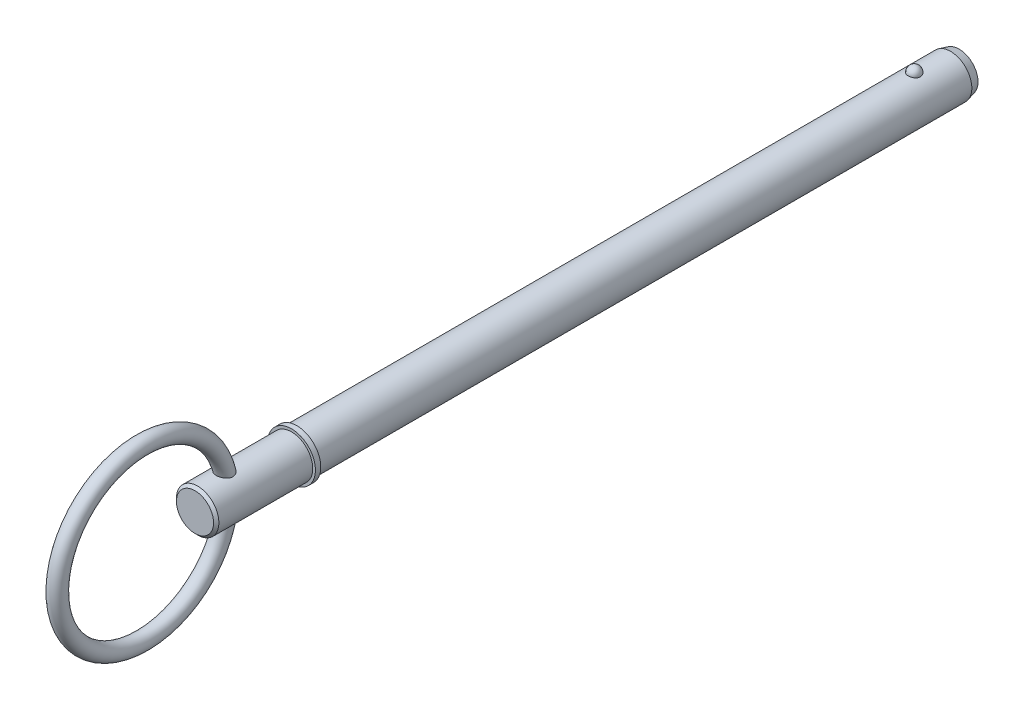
ISO-10303-21;
HEADER;
FILE_DESCRIPTION(('STEP AP214'),'2;1');
FILE_NAME('part.step','',(''),(''),'','','');
FILE_SCHEMA(('AUTOMOTIVE_DESIGN { 1 0 10303 214 1 1 1 1 }'));
ENDSEC;
DATA;
#1=APPLICATION_CONTEXT('core data for automotive mechanical design processes');
#2=APPLICATION_PROTOCOL_DEFINITION('international standard','automotive_design',2000,#1);
#3=PRODUCT_CONTEXT('',#1,'mechanical');
#4=PRODUCT('Part','Part','',(#3));
#5=PRODUCT_RELATED_PRODUCT_CATEGORY('part','',(#4));
#6=PRODUCT_DEFINITION_FORMATION('','',#4);
#7=PRODUCT_DEFINITION_CONTEXT('part definition',#1,'design');
#8=PRODUCT_DEFINITION('design','',#6,#7);
#9=PRODUCT_DEFINITION_SHAPE('','',#8);
#10=(LENGTH_UNIT() NAMED_UNIT(*) SI_UNIT(.MILLI.,.METRE.));
#11=(NAMED_UNIT(*) PLANE_ANGLE_UNIT() SI_UNIT($,.RADIAN.));
#12=(NAMED_UNIT(*) SI_UNIT($,.STERADIAN.) SOLID_ANGLE_UNIT());
#13=UNCERTAINTY_MEASURE_WITH_UNIT(LENGTH_MEASURE(1.E-05),#10,'distance_accuracy_value','');
#14=(GEOMETRIC_REPRESENTATION_CONTEXT(3) GLOBAL_UNCERTAINTY_ASSIGNED_CONTEXT((#13)) GLOBAL_UNIT_ASSIGNED_CONTEXT((#10,
#11,#12)) REPRESENTATION_CONTEXT('',''));
#15=CARTESIAN_POINT('',(0.,0.,0.));
#16=DIRECTION('',(0.,0.,1.));
#17=DIRECTION('',(1.,0.,0.));
#18=AXIS2_PLACEMENT_3D('',#15,#16,#17);
#19=CARTESIAN_POINT('',(0.,0.,114.3));
#20=DIRECTION('',(0.,0.,-1.));
#21=DIRECTION('',(-1.,0.,0.));
#22=AXIS2_PLACEMENT_3D('',#19,#20,#21);
#23=CYLINDRICAL_SURFACE('',#22,3.97);
#24=CARTESIAN_POINT('',(1.13787398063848,3.80343828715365,-1.14999999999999));
#25=CARTESIAN_POINT('',(1.13787307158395,3.80343910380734,-1.08573978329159));
#26=CARTESIAN_POINT('',(1.13264657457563,3.80501406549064,-1.02146820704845));
#27=CARTESIAN_POINT('',(1.11186534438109,3.81113760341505,-0.89474994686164));
#28=CARTESIAN_POINT('',(1.09630734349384,3.81568712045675,-0.832303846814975));
#29=CARTESIAN_POINT('',(1.05525533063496,3.82724281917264,-0.711040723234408));
#30=CARTESIAN_POINT('',(1.02976565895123,3.83424792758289,-0.652222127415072));
#31=CARTESIAN_POINT('',(0.969477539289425,3.84993235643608,-0.539814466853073));
#32=CARTESIAN_POINT('',(0.934679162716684,3.85861166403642,-0.486225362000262));
#33=CARTESIAN_POINT('',(0.856427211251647,3.87673176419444,-0.385470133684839));
#34=CARTESIAN_POINT('',(0.812928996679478,3.88617632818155,-0.338339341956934));
#35=CARTESIAN_POINT('',(0.718506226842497,3.90473543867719,-0.252134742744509));
#36=CARTESIAN_POINT('',(0.667581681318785,3.91384998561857,-0.213060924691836));
#37=CARTESIAN_POINT('',(0.559829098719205,3.93070626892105,-0.144169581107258));
#38=CARTESIAN_POINT('',(0.503019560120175,3.93845211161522,-0.114324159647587));
#39=CARTESIAN_POINT('',(0.384957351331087,3.95173781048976,-0.0645874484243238));
#40=CARTESIAN_POINT('',(0.323705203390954,3.95727792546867,-0.044694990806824));
#41=CARTESIAN_POINT('',(0.1997490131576,3.96544869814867,-0.015729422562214));
#42=CARTESIAN_POINT('',(0.137095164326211,3.96813298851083,-0.00645660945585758));
#43=CARTESIAN_POINT('',(0.0110617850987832,3.97048461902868,0.0016793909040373));
#44=CARTESIAN_POINT('',(-0.0523176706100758,3.97015226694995,0.00054364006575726));
#45=CARTESIAN_POINT('',(-0.176983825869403,3.96653606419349,-0.0120046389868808));
#46=CARTESIAN_POINT('',(-0.238287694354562,3.96329719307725,-0.0232605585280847));
#47=CARTESIAN_POINT('',(-0.358077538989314,3.95427494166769,-0.0555133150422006));
#48=CARTESIAN_POINT('',(-0.41656346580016,3.94849151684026,-0.0765103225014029));
#49=CARTESIAN_POINT('',(-0.529474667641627,3.9349475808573,-0.127824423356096));
#50=CARTESIAN_POINT('',(-0.583873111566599,3.92717527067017,-0.158197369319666));
#51=CARTESIAN_POINT('',(-0.686796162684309,3.9104901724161,-0.227402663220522));
#52=CARTESIAN_POINT('',(-0.735320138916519,3.90157726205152,-0.266235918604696));
#53=CARTESIAN_POINT('',(-0.826197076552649,3.88336108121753,-0.352210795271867));
#54=CARTESIAN_POINT('',(-0.868404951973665,3.87405356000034,-0.399504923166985));
#55=CARTESIAN_POINT('',(-0.944393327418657,3.85623507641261,-0.500572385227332));
#56=CARTESIAN_POINT('',(-0.978173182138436,3.84772417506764,-0.5543462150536));
#57=CARTESIAN_POINT('',(-1.036841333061,3.83233550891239,-0.66762403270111));
#58=CARTESIAN_POINT('',(-1.06161430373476,3.82547928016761,-0.727190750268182));
#59=CARTESIAN_POINT('',(-1.1010562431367,3.81431496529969,-0.849806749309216));
#60=CARTESIAN_POINT('',(-1.11572551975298,3.81000680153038,-0.9128559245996));
#61=CARTESIAN_POINT('',(-1.13455293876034,3.80444307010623,-1.0403529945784));
#62=CARTESIAN_POINT('',(-1.13875701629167,3.80317416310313,-1.10479351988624));
#63=CARTESIAN_POINT('',(-1.13668244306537,3.80379469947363,-1.23348881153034));
#64=CARTESIAN_POINT('',(-1.13040410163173,3.80568404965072,-1.29774358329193));
#65=CARTESIAN_POINT('',(-1.10758455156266,3.81238701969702,-1.42388263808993));
#66=CARTESIAN_POINT('',(-1.09109911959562,3.81718474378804,-1.48577787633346));
#67=CARTESIAN_POINT('',(-1.04831897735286,3.82915360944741,-1.60583632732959));
#68=CARTESIAN_POINT('',(-1.02202385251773,3.83632485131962,-1.66399938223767));
#69=CARTESIAN_POINT('',(-0.960087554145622,3.85229234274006,-1.77531672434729));
#70=CARTESIAN_POINT('',(-0.924393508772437,3.86109769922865,-1.82844028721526));
#71=CARTESIAN_POINT('',(-0.844617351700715,3.87932868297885,-1.9278464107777));
#72=CARTESIAN_POINT('',(-0.800534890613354,3.88875433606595,-1.97412868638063));
#73=CARTESIAN_POINT('',(-0.704909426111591,3.90722138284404,-2.05875748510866));
#74=CARTESIAN_POINT('',(-0.653336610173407,3.91626104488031,-2.09707073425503));
#75=CARTESIAN_POINT('',(-0.544251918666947,3.93290335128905,-2.16444159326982));
#76=CARTESIAN_POINT('',(-0.486740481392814,3.94050610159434,-2.19349988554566));
#77=CARTESIAN_POINT('',(-0.368186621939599,3.95333328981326,-2.2412060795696));
#78=CARTESIAN_POINT('',(-0.307200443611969,3.9585876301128,-2.25998559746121));
#79=CARTESIAN_POINT('',(-0.182787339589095,3.96627905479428,-2.28716436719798));
#80=CARTESIAN_POINT('',(-0.119360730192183,3.96871650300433,-2.29556495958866));
#81=CARTESIAN_POINT('',(0.00676344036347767,3.97048518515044,-2.30167748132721));
#82=CARTESIAN_POINT('',(0.0694499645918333,3.96987797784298,-2.29960123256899));
#83=CARTESIAN_POINT('',(0.193555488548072,3.96576491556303,-2.28530777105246));
#84=CARTESIAN_POINT('',(0.254974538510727,3.96225917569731,-2.2730909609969));
#85=CARTESIAN_POINT('',(0.374550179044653,3.95274547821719,-2.23893840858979));
#86=CARTESIAN_POINT('',(0.432719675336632,3.94674835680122,-2.21704472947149));
#87=CARTESIAN_POINT('',(0.544514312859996,3.93288448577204,-2.16414952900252));
#88=CARTESIAN_POINT('',(0.598139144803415,3.92501760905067,-2.13314738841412));
#89=CARTESIAN_POINT('',(0.700284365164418,3.90809781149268,-2.06228741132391));
#90=CARTESIAN_POINT('',(0.748708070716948,3.89902775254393,-2.0222943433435));
#91=CARTESIAN_POINT('',(0.838215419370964,3.88077133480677,-1.93481443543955));
#92=CARTESIAN_POINT('',(0.879297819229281,3.87158495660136,-1.88732632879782));
#93=CARTESIAN_POINT('',(0.953804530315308,3.85391414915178,-1.78516284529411));
#94=CARTESIAN_POINT('',(0.987071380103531,3.8454460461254,-1.73036973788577));
#95=CARTESIAN_POINT('',(1.04410491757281,3.83035507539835,-1.61582422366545));
#96=CARTESIAN_POINT('',(1.06787445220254,3.82373165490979,-1.55607330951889));
#97=CARTESIAN_POINT('',(1.10358064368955,3.813570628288,-1.43904746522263));
#98=CARTESIAN_POINT('',(1.11641754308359,3.80980198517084,-1.38206535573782));
#99=CARTESIAN_POINT('',(1.13356451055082,3.80473547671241,-1.26672526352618));
#100=CARTESIAN_POINT('',(1.13787480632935,3.80343754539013,-1.20836731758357));
#101=CARTESIAN_POINT('',(1.13787398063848,3.80343828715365,-1.14999999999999));
#102=B_SPLINE_CURVE_WITH_KNOTS('',3,(#24,#25,#26,#27,#28,#29,#30,#31,#32,#33,#34,#35,#36,#37,
#38,#39,#40,#41,#42,#43,#44,#45,#46,#47,#48,#49,#50,#51,#52,#53,#54,#55,#56,#57,#58,#59,#60,#61,
#62,#63,#64,#65,#66,#67,#68,#69,#70,#71,#72,#73,#74,#75,#76,#77,#78,#79,#80,#81,#82,#83,#84,#85,
#86,#87,#88,#89,#90,#91,#92,#93,#94,#95,#96,#97,#98,#99,#100,#101),.UNSPECIFIED.,.T.,.F.,(4,2,2,
2,2,2,2,2,2,2,2,2,2,2,2,2,2,2,2,2,2,2,2,2,2,2,2,2,2,2,2,2,2,2,2,2,2,2,4),(0.,0.192571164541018,
0.385203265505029,0.577751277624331,0.770297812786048,0.963858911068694,1.15741975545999,
1.35038964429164,1.54333688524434,1.73259288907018,1.92182958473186,2.10818732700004,
2.2945483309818,2.48204164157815,2.66955507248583,2.86087083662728,3.05220124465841,
3.24590171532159,3.43959628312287,3.63243915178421,3.82527632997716,4.01706893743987,
4.20886965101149,4.40177324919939,4.59468488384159,4.78838651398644,4.9820738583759,
5.17321934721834,5.36434014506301,5.55161251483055,5.7388774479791,5.92533626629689,
6.11180776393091,6.30129785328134,6.49082000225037,6.68388392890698,6.87688993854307,
7.05180628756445,7.22671796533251),.UNSPECIFIED.);
#103=CARTESIAN_POINT('',(1.13787398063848,3.80343828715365,-1.14999999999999));
#104=VERTEX_POINT('',#103);
#105=EDGE_CURVE('E102',#104,#104,#102,.T.);
#106=ORIENTED_EDGE('',*,*,#105,.T.);
#107=EDGE_LOOP('',(#106));
#108=FACE_BOUND('',#107,.T.);
#109=CARTESIAN_POINT('',(0.,0.,-7.94400000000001));
#110=DIRECTION('',(0.,0.,-1.));
#111=DIRECTION('',(-1.,0.,0.));
#112=AXIS2_PLACEMENT_3D('',#109,#110,#111);
#113=CIRCLE('',#112,3.97);
#114=CARTESIAN_POINT('',(-3.97,0.,-7.94400000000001));
#115=VERTEX_POINT('',#114);
#116=EDGE_CURVE('E109',#115,#115,#113,.F.);
#117=ORIENTED_EDGE('',*,*,#116,.T.);
#118=EDGE_LOOP('',(#117));
#119=FACE_BOUND('',#118,.T.);
#120=CARTESIAN_POINT('',(0.,0.,114.3));
#121=DIRECTION('',(0.,0.,1.));
#122=DIRECTION('',(1.,0.,0.));
#123=AXIS2_PLACEMENT_3D('',#120,#121,#122);
#124=CIRCLE('',#123,3.97);
#125=CARTESIAN_POINT('',(3.97,0.,114.3));
#126=VERTEX_POINT('',#125);
#127=EDGE_CURVE('E107',#126,#126,#124,.T.);
#128=ORIENTED_EDGE('',*,*,#127,.F.);
#129=EDGE_LOOP('',(#128));
#130=FACE_BOUND('',#129,.T.);
#131=ADVANCED_FACE('F39',(#108,#119,#130),#23,.T.);
#132=CARTESIAN_POINT('',(0.,0.,-9.53));
#133=DIRECTION('',(0.,0.,-1.));
#134=DIRECTION('',(-1.,0.,0.));
#135=AXIS2_PLACEMENT_3D('',#132,#133,#134);
#136=PLANE('',#135);
#137=CARTESIAN_POINT('',(0.,0.,-9.53));
#138=DIRECTION('',(0.,0.,-1.));
#139=DIRECTION('',(-1.,0.,0.));
#140=AXIS2_PLACEMENT_3D('',#137,#138,#139);
#141=CIRCLE('',#140,3.54503258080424);
#142=CARTESIAN_POINT('',(-3.54503258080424,0.,-9.53));
#143=VERTEX_POINT('',#142);
#144=EDGE_CURVE('E141',#143,#143,#141,.T.);
#145=ORIENTED_EDGE('',*,*,#144,.T.);
#146=EDGE_LOOP('',(#145));
#147=FACE_BOUND('',#146,.T.);
#148=ADVANCED_FACE('F88',(#147),#136,.T.);
#149=CARTESIAN_POINT('',(0.,0.,-9.53));
#150=DIRECTION('',(0.,0.,1.));
#151=DIRECTION('',(1.,0.,0.));
#152=AXIS2_PLACEMENT_3D('',#149,#150,#151);
#153=CONICAL_SURFACE('',#152,3.54503258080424,0.26179938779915);
#154=ORIENTED_EDGE('',*,*,#116,.F.);
#155=EDGE_LOOP('',(#154));
#156=FACE_BOUND('',#155,.T.);
#157=ORIENTED_EDGE('',*,*,#144,.F.);
#158=EDGE_LOOP('',(#157));
#159=FACE_BOUND('',#158,.T.);
#160=ADVANCED_FACE('F94',(#156,#159),#153,.T.);
#161=CARTESIAN_POINT('',(0.,3.97,-1.14999999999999));
#162=DIRECTION('',(0.,1.,0.));
#163=DIRECTION('',(0.,0.,-1.));
#164=AXIS2_PLACEMENT_3D('',#161,#162,#163);
#165=SPHERICAL_SURFACE('',#164,1.15);
#166=ORIENTED_EDGE('',*,*,#105,.F.);
#167=EDGE_LOOP('',(#166));
#168=FACE_BOUND('',#167,.T.);
#169=ADVANCED_FACE('F112',(#168),#165,.T.);
#170=CARTESIAN_POINT('',(0.,0.,114.3));
#171=DIRECTION('',(0.,0.,-1.));
#172=DIRECTION('',(-1.,0.,0.));
#173=AXIS2_PLACEMENT_3D('',#170,#171,#172);
#174=PLANE('',#173);
#175=ORIENTED_EDGE('',*,*,#127,.T.);
#176=EDGE_LOOP('',(#175));
#177=FACE_BOUND('',#176,.T.);
#178=CARTESIAN_POINT('',(0.,0.,114.3));
#179=DIRECTION('',(0.,0.,-1.));
#180=DIRECTION('',(-1.,0.,0.));
#181=AXIS2_PLACEMENT_3D('',#178,#179,#180);
#182=CIRCLE('',#181,4.47);
#183=CARTESIAN_POINT('',(-4.47,0.,114.3));
#184=VERTEX_POINT('',#183);
#185=EDGE_CURVE('E108',#184,#184,#182,.T.);
#186=ORIENTED_EDGE('',*,*,#185,.T.);
#187=EDGE_LOOP('',(#186));
#188=FACE_BOUND('',#187,.T.);
#189=ADVANCED_FACE('F116',(#177,#188),#174,.T.);
#190=CARTESIAN_POINT('',(0.,0.,33.7287874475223));
#191=DIRECTION('',(0.,0.,-1.));
#192=DIRECTION('',(-1.,0.,0.));
#193=AXIS2_PLACEMENT_3D('',#190,#191,#192);
#194=CYLINDRICAL_SURFACE('',#193,4.47);
#195=CARTESIAN_POINT('',(0.,0.,115.3));
#196=DIRECTION('',(0.,0.,-1.));
#197=DIRECTION('',(-1.,0.,0.));
#198=AXIS2_PLACEMENT_3D('',#195,#196,#197);
#199=CIRCLE('',#198,4.47);
#200=CARTESIAN_POINT('',(-4.47,0.,115.3));
#201=VERTEX_POINT('',#200);
#202=EDGE_CURVE('E133',#201,#201,#199,.T.);
#203=ORIENTED_EDGE('',*,*,#202,.T.);
#204=EDGE_LOOP('',(#203));
#205=FACE_BOUND('',#204,.T.);
#206=ORIENTED_EDGE('',*,*,#185,.F.);
#207=EDGE_LOOP('',(#206));
#208=FACE_BOUND('',#207,.T.);
#209=ADVANCED_FACE('F120',(#205,#208),#194,.T.);
#210=CARTESIAN_POINT('',(0.,4.47,115.3));
#211=DIRECTION('',(0.,0.,1.));
#212=DIRECTION('',(1.,0.,0.));
#213=AXIS2_PLACEMENT_3D('',#210,#211,#212);
#214=PLANE('',#213);
#215=CARTESIAN_POINT('',(0.,0.,115.3));
#216=DIRECTION('',(0.,0.,1.));
#217=DIRECTION('',(1.,0.,0.));
#218=AXIS2_PLACEMENT_3D('',#215,#216,#217);
#219=CIRCLE('',#218,3.97);
#220=CARTESIAN_POINT('',(3.97,0.,115.3));
#221=VERTEX_POINT('',#220);
#222=EDGE_CURVE('E111',#221,#221,#219,.T.);
#223=ORIENTED_EDGE('',*,*,#222,.F.);
#224=EDGE_LOOP('',(#223));
#225=FACE_BOUND('',#224,.T.);
#226=ORIENTED_EDGE('',*,*,#202,.F.);
#227=EDGE_LOOP('',(#226));
#228=FACE_BOUND('',#227,.T.);
#229=ADVANCED_FACE('F85',(#225,#228),#214,.T.);
#230=CARTESIAN_POINT('',(0.,0.,133.35));
#231=DIRECTION('',(0.,0.,-1.));
#232=DIRECTION('',(-1.,0.,0.));
#233=AXIS2_PLACEMENT_3D('',#230,#231,#232);
#234=CYLINDRICAL_SURFACE('',#233,3.97);
#235=CARTESIAN_POINT('',(-0.740636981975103,-3.90030215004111,126.494208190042));
#236=CARTESIAN_POINT('',(-0.667733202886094,-3.91414543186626,126.454930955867));
#237=CARTESIAN_POINT('',(-0.591347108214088,-3.92651643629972,126.421598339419));
#238=CARTESIAN_POINT('',(-0.433709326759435,-3.94703799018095,126.367541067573));
#239=CARTESIAN_POINT('',(-0.352458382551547,-3.95518918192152,126.34681449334));
#240=CARTESIAN_POINT('',(-0.187320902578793,-3.96644185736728,126.318426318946));
#241=CARTESIAN_POINT('',(-0.103433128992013,-3.9695409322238,126.310770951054));
#242=CARTESIAN_POINT('',(0.0645297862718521,-3.97036376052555,126.308726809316));
#243=CARTESIAN_POINT('',(0.148604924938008,-3.96808759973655,126.314337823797));
#244=CARTESIAN_POINT('',(0.313967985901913,-3.95842655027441,126.338610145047));
#245=CARTESIAN_POINT('',(0.395270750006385,-3.95107581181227,126.357184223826));
#246=CARTESIAN_POINT('',(0.553418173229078,-3.93204472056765,126.406869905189));
#247=CARTESIAN_POINT('',(0.630262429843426,-3.92036397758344,126.437982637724));
#248=CARTESIAN_POINT('',(0.777983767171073,-3.89375421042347,126.512373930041));
#249=CARTESIAN_POINT('',(0.848809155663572,-3.8788003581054,126.555746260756));
#250=CARTESIAN_POINT('',(0.981880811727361,-3.84727071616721,126.653651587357));
#251=CARTESIAN_POINT('',(1.04412630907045,-3.83069478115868,126.708185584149));
#252=CARTESIAN_POINT('',(1.15846819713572,-3.79768496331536,126.827439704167));
#253=CARTESIAN_POINT('',(1.21053047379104,-3.78125172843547,126.892192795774));
#254=CARTESIAN_POINT('',(1.30266807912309,-3.75050988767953,127.030169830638));
#255=CARTESIAN_POINT('',(1.34274789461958,-3.73620048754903,127.103390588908));
#256=CARTESIAN_POINT('',(1.40857853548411,-3.71187334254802,127.253627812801));
#257=CARTESIAN_POINT('',(1.43477198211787,-3.70172571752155,127.330429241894));
#258=CARTESIAN_POINT('',(1.47426417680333,-3.68617713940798,127.487721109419));
#259=CARTESIAN_POINT('',(1.48756557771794,-3.68077520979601,127.568210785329));
#260=CARTESIAN_POINT('',(1.5011302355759,-3.67526295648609,127.728277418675));
#261=CARTESIAN_POINT('',(1.50172918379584,-3.67501639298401,127.807822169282));
#262=CARTESIAN_POINT('',(1.4912869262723,-3.67926498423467,127.966001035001));
#263=CARTESIAN_POINT('',(1.48024221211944,-3.68376156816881,128.044634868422));
#264=CARTESIAN_POINT('',(1.44631002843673,-3.69722026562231,128.203996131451));
#265=CARTESIAN_POINT('',(1.42273446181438,-3.7064405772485,128.284553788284));
#266=CARTESIAN_POINT('',(1.36440745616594,-3.72830487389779,128.441022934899));
#267=CARTESIAN_POINT('',(1.32965006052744,-3.74095068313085,128.516931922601));
#268=CARTESIAN_POINT('',(1.244983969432,-3.77003365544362,128.671589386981));
#269=CARTESIAN_POINT('',(1.19374759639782,-3.78674477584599,128.749562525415));
#270=CARTESIAN_POINT('',(1.07927226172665,-3.82094743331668,128.896060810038));
#271=CARTESIAN_POINT('',(1.01602347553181,-3.83843960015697,128.964578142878));
#272=CARTESIAN_POINT('',(0.875824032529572,-3.87288453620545,129.092242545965));
#273=CARTESIAN_POINT('',(0.798445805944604,-3.88979192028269,129.15093750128));
#274=CARTESIAN_POINT('',(0.633271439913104,-3.92005992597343,129.252448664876));
#275=CARTESIAN_POINT('',(0.545492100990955,-3.9334261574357,129.295290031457));
#276=CARTESIAN_POINT('',(0.374503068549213,-3.9531041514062,129.357302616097));
#277=CARTESIAN_POINT('',(0.292250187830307,-3.96011991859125,129.378871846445));
#278=CARTESIAN_POINT('',(0.124887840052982,-3.96891507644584,129.405817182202));
#279=CARTESIAN_POINT('',(0.0397822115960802,-3.97070123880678,129.411214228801));
#280=CARTESIAN_POINT('',(-0.116598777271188,-3.96893737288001,129.405841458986));
#281=CARTESIAN_POINT('',(-0.187977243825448,-3.96616998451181,129.39744312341));
#282=CARTESIAN_POINT('',(-0.328224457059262,-3.95703238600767,129.36934593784));
#283=CARTESIAN_POINT('',(-0.397092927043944,-3.95066177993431,129.349645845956));
#284=CARTESIAN_POINT('',(-0.530777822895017,-3.93493622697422,129.300002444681));
#285=CARTESIAN_POINT('',(-0.595585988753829,-3.92557541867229,129.270039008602));
#286=CARTESIAN_POINT('',(-0.719890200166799,-3.904694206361,129.201221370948));
#287=CARTESIAN_POINT('',(-0.779384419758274,-3.89317306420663,129.162364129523));
#288=CARTESIAN_POINT('',(-0.900171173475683,-3.86715924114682,129.071135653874));
#289=CARTESIAN_POINT('',(-0.960570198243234,-3.85247602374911,129.017637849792));
#290=CARTESIAN_POINT('',(-1.07286582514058,-3.82272677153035,128.902437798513));
#291=CARTESIAN_POINT('',(-1.12475588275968,-3.8076604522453,128.84072930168));
#292=CARTESIAN_POINT('',(-1.22682603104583,-3.7761197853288,128.700307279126));
#293=CARTESIAN_POINT('',(-1.27547686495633,-3.75979238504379,128.620442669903));
#294=CARTESIAN_POINT('',(-1.3595646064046,-3.73021138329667,128.453453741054));
#295=CARTESIAN_POINT('',(-1.39499536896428,-3.71695921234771,128.366326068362));
#296=CARTESIAN_POINT('',(-1.45224550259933,-3.6949785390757,128.183764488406));
#297=CARTESIAN_POINT('',(-1.47355906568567,-3.68641985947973,128.088148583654));
#298=CARTESIAN_POINT('',(-1.49891316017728,-3.67618897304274,127.894306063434));
#299=CARTESIAN_POINT('',(-1.50297414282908,-3.67450861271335,127.796082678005));
#300=CARTESIAN_POINT('',(-1.49322338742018,-3.67847743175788,127.611520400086));
#301=CARTESIAN_POINT('',(-1.48132891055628,-3.68334053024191,127.525062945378));
#302=CARTESIAN_POINT('',(-1.44277978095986,-3.69860964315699,127.356020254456));
#303=CARTESIAN_POINT('',(-1.4161310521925,-3.70901343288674,127.273433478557));
#304=CARTESIAN_POINT('',(-1.35164005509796,-3.73296583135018,127.121743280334));
#305=CARTESIAN_POINT('',(-1.31494998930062,-3.74616939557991,127.052090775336));
#306=CARTESIAN_POINT('',(-1.23078033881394,-3.77465882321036,126.920114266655));
#307=CARTESIAN_POINT('',(-1.18329862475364,-3.7899450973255,126.85779171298));
#308=CARTESIAN_POINT('',(-1.07555346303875,-3.82196646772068,126.738244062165));
#309=CARTESIAN_POINT('',(-1.01467770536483,-3.83873247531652,126.68157898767));
#310=CARTESIAN_POINT('',(-0.88392500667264,-3.87093079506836,126.579334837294));
#311=CARTESIAN_POINT('',(-0.81404638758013,-3.88636285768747,126.533757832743));
#312=CARTESIAN_POINT('',(-0.740636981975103,-3.90030215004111,126.494208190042));
#313=B_SPLINE_CURVE_WITH_KNOTS('',3,(#235,#236,#237,#238,#239,#240,#241,#242,#243,#244,#245,
#246,#247,#248,#249,#250,#251,#252,#253,#254,#255,#256,#257,#258,#259,#260,#261,#262,#263,#264,
#265,#266,#267,#268,#269,#270,#271,#272,#273,#274,#275,#276,#277,#278,#279,#280,#281,#282,#283,
#284,#285,#286,#287,#288,#289,#290,#291,#292,#293,#294,#295,#296,#297,#298,#299,#300,#301,#302,
#303,#304,#305,#306,#307,#308,#309,#310,#311,#312),.UNSPECIFIED.,.T.,.F.,(4,2,2,2,2,2,2,2,2,2,2,
2,2,2,2,2,2,2,2,2,2,2,2,2,2,2,2,2,2,2,2,2,2,2,2,2,2,2,4),(0.,0.251585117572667,
0.503131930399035,0.754798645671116,1.00646134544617,1.25644674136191,1.50645467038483,
1.75842915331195,2.01042624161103,2.26325358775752,2.51598614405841,2.76008726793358,
3.00413815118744,3.24173115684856,3.47939577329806,3.73171171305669,3.9841622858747,
4.26728153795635,4.5506333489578,4.8446962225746,5.1382904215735,5.39265192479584,
5.64668391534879,5.86142364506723,6.07618697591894,6.29137389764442,6.50663447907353,
6.75172833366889,6.9970098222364,7.28055118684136,7.56422418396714,7.85757857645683,
8.15058512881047,8.41135406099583,8.67201836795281,8.9103901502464,9.14880900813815,
9.40209172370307,9.65542171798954),.UNSPECIFIED.);
#314=CARTESIAN_POINT('',(-0.740636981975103,-3.90030215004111,126.494208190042));
#315=VERTEX_POINT('',#314);
#316=EDGE_CURVE('E10',#315,#315,#313,.T.);
#317=ORIENTED_EDGE('',*,*,#316,.F.);
#318=EDGE_LOOP('',(#317));
#319=FACE_BOUND('',#318,.T.);
#320=CARTESIAN_POINT('',(-0.740636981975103,3.90030215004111,126.494208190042));
#321=CARTESIAN_POINT('',(-0.813118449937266,3.88653971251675,126.533257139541));
#322=CARTESIAN_POINT('',(-0.882149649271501,3.8713229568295,126.57817811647));
#323=CARTESIAN_POINT('',(-1.01146335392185,3.83956738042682,126.678842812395));
#324=CARTESIAN_POINT('',(-1.07174704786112,3.82302873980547,126.734585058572));
#325=CARTESIAN_POINT('',(-1.18196955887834,3.79040422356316,126.855793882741));
#326=CARTESIAN_POINT('',(-1.23189269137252,3.77431906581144,126.921274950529));
#327=CARTESIAN_POINT('',(-1.31978443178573,3.74449359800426,127.060294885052));
#328=CARTESIAN_POINT('',(-1.35775694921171,3.73075252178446,127.133831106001));
#329=CARTESIAN_POINT('',(-1.41974909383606,3.7075981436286,127.284712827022));
#330=CARTESIAN_POINT('',(-1.44413408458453,3.69807309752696,127.361891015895));
#331=CARTESIAN_POINT('',(-1.4800654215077,3.6838411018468,127.519590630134));
#332=CARTESIAN_POINT('',(-1.49161368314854,3.67913343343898,127.600111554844));
#333=CARTESIAN_POINT('',(-1.50187378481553,3.67495610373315,127.760261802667));
#334=CARTESIAN_POINT('',(-1.50086613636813,3.67537197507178,127.839870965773));
#335=CARTESIAN_POINT('',(-1.48728932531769,3.68088569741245,127.99791727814));
#336=CARTESIAN_POINT('',(-1.47471654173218,3.68598501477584,128.076354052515));
#337=CARTESIAN_POINT('',(-1.43761932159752,3.70061780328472,128.23559408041));
#338=CARTESIAN_POINT('',(-1.41233843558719,3.71042990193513,128.316194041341));
#339=CARTESIAN_POINT('',(-1.35057314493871,3.73335405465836,128.472485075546));
#340=CARTESIAN_POINT('',(-1.31408239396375,3.74646797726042,128.548173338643));
#341=CARTESIAN_POINT('',(-1.2257172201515,3.77636700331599,128.702042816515));
#342=CARTESIAN_POINT('',(-1.17251505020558,3.79340436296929,128.779416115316));
#343=CARTESIAN_POINT('',(-1.05406412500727,3.82800923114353,128.924306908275));
#344=CARTESIAN_POINT('',(-0.98880624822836,3.84557713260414,128.991816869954));
#345=CARTESIAN_POINT('',(-0.845287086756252,3.87968695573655,129.116221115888));
#346=CARTESIAN_POINT('',(-0.766724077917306,3.89618874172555,129.17278225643));
#347=CARTESIAN_POINT('',(-0.5995381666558,3.92537936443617,129.269696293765));
#348=CARTESIAN_POINT('',(-0.510933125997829,3.93807482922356,129.310077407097));
#349=CARTESIAN_POINT('',(-0.339677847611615,3.95624165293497,129.367008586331));
#350=CARTESIAN_POINT('',(-0.257968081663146,3.96248273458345,129.386128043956));
#351=CARTESIAN_POINT('',(-0.0922002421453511,3.96979198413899,129.40847364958));
#352=CARTESIAN_POINT('',(-0.00814495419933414,3.97086604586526,129.411717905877));
#353=CARTESIAN_POINT('',(0.146484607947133,3.96793776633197,129.402797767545));
#354=CARTESIAN_POINT('',(0.217212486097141,3.96466338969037,129.392843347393));
#355=CARTESIAN_POINT('',(0.355938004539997,3.95462310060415,129.36188886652));
#356=CARTESIAN_POINT('',(0.423935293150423,3.94785673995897,129.340887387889));
#357=CARTESIAN_POINT('',(0.556534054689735,3.93137424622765,129.288614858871));
#358=CARTESIAN_POINT('',(0.62107563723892,3.92161865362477,129.257205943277));
#359=CARTESIAN_POINT('',(0.744663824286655,3.90004074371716,129.18557567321));
#360=CARTESIAN_POINT('',(0.803708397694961,3.88821766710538,129.145351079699));
#361=CARTESIAN_POINT('',(0.923664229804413,3.86161149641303,129.051056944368));
#362=CARTESIAN_POINT('',(0.983622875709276,3.84664723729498,128.995828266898));
#363=CARTESIAN_POINT('',(1.09477654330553,3.81650197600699,128.877194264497));
#364=CARTESIAN_POINT('',(1.14596459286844,3.80132081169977,128.81378250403));
#365=CARTESIAN_POINT('',(1.24603510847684,3.76980809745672,128.669989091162));
#366=CARTESIAN_POINT('',(1.29338223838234,3.753652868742,128.588493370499));
#367=CARTESIAN_POINT('',(1.37450267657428,3.72471527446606,128.41839607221));
#368=CARTESIAN_POINT('',(1.40827109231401,3.7119341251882,128.329791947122));
#369=CARTESIAN_POINT('',(1.46140533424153,3.6913461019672,128.14554366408));
#370=CARTESIAN_POINT('',(1.48042991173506,3.6836576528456,128.04978594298));
#371=CARTESIAN_POINT('',(1.50115029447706,3.67526750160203,127.856128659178));
#372=CARTESIAN_POINT('',(1.50286713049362,3.67455732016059,127.758231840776));
#373=CARTESIAN_POINT('',(1.48878143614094,3.68028077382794,127.575208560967));
#374=CARTESIAN_POINT('',(1.47496153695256,3.68590609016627,127.48990287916));
#375=CARTESIAN_POINT('',(1.43287242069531,3.70247002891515,127.323476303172));
#376=CARTESIAN_POINT('',(1.40460762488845,3.7134070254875,127.24235413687));
#377=CARTESIAN_POINT('',(1.33714680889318,3.7381964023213,127.093104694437));
#378=CARTESIAN_POINT('',(1.29898330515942,3.7517524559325,127.024457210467));
#379=CARTESIAN_POINT('',(1.21206000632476,3.78072797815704,126.894682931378));
#380=CARTESIAN_POINT('',(1.16329942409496,3.79614758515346,126.833556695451));
#381=CARTESIAN_POINT('',(1.05526740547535,3.82760231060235,126.718865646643));
#382=CARTESIAN_POINT('',(0.99578298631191,3.84364346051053,126.665503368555));
#383=CARTESIAN_POINT('',(0.868651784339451,3.8743538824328,126.56909984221));
#384=CARTESIAN_POINT('',(0.801003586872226,3.88902291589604,126.526060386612));
#385=CARTESIAN_POINT('',(0.656696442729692,3.91602140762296,126.449789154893));
#386=CARTESIAN_POINT('',(0.579799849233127,3.92824686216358,126.41696915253));
#387=CARTESIAN_POINT('',(0.42121988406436,3.94839960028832,126.364037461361));
#388=CARTESIAN_POINT('',(0.339536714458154,3.95632706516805,126.343925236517));
#389=CARTESIAN_POINT('',(0.173681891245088,3.96706909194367,126.316866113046));
#390=CARTESIAN_POINT('',(0.0895101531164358,3.96988347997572,126.309919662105));
#391=CARTESIAN_POINT('',(-0.0788915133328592,3.97010941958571,126.309358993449));
#392=CARTESIAN_POINT('',(-0.163121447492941,3.96752031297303,126.315746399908));
#393=CARTESIAN_POINT('',(-0.33291130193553,3.9569711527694,126.342287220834));
#394=CARTESIAN_POINT('',(-0.418363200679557,3.9487768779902,126.363041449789));
#395=CARTESIAN_POINT('',(-0.584033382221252,3.92769448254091,126.418425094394));
#396=CARTESIAN_POINT('',(-0.664251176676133,3.91480592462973,126.453055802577));
#397=CARTESIAN_POINT('',(-0.740636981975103,3.90030215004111,126.494208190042));
#398=B_SPLINE_CURVE_WITH_KNOTS('',3,(#320,#321,#322,#323,#324,#325,#326,#327,#328,#329,#330,
#331,#332,#333,#334,#335,#336,#337,#338,#339,#340,#341,#342,#343,#344,#345,#346,#347,#348,#349,
#350,#351,#352,#353,#354,#355,#356,#357,#358,#359,#360,#361,#362,#363,#364,#365,#366,#367,#368,
#369,#370,#371,#372,#373,#374,#375,#376,#377,#378,#379,#380,#381,#382,#383,#384,#385,#386,#387,
#388,#389,#390,#391,#392,#393,#394,#395,#396,#397),.UNSPECIFIED.,.T.,.F.,(4,2,2,2,2,2,2,2,2,2,2,
2,2,2,2,2,2,2,2,2,2,2,2,2,2,2,2,2,2,2,2,2,2,2,2,2,2,2,4),(0.,0.250115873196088,
0.500197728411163,0.750655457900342,1.00103116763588,1.24430196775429,1.48753646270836,
1.72534678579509,1.96323159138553,2.21733609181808,2.47158471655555,2.75662009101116,
3.04187201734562,3.33477180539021,3.62715855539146,3.8780351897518,4.12862559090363,
4.34211896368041,4.55563974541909,4.7721103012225,4.98866052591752,5.23635199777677,
5.48423946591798,5.76983687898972,6.05553710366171,6.34766729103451,6.63944246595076,
6.89782349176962,7.15612548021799,7.39414671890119,7.63218564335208,7.87561406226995,
8.11908472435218,8.37137533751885,8.62365530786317,8.87594385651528,9.12826313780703,
9.39182737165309,9.65541616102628),.UNSPECIFIED.);
#399=CARTESIAN_POINT('',(-0.740636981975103,3.90030215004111,126.494208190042));
#400=VERTEX_POINT('',#399);
#401=EDGE_CURVE('E51',#400,#400,#398,.T.);
#402=ORIENTED_EDGE('',*,*,#401,.F.);
#403=EDGE_LOOP('',(#402));
#404=FACE_BOUND('',#403,.T.);
#405=CARTESIAN_POINT('',(0.,0.,132.85));
#406=DIRECTION('',(0.,0.,-1.));
#407=DIRECTION('',(-1.,0.,0.));
#408=AXIS2_PLACEMENT_3D('',#405,#406,#407);
#409=CIRCLE('',#408,3.97);
#410=CARTESIAN_POINT('',(-3.97,0.,132.85));
#411=VERTEX_POINT('',#410);
#412=EDGE_CURVE('E64',#411,#411,#409,.T.);
#413=ORIENTED_EDGE('',*,*,#412,.T.);
#414=EDGE_LOOP('',(#413));
#415=FACE_BOUND('',#414,.T.);
#416=ORIENTED_EDGE('',*,*,#222,.T.);
#417=EDGE_LOOP('',(#416));
#418=FACE_BOUND('',#417,.T.);
#419=ADVANCED_FACE('F69',(#319,#404,#415,#418),#234,.T.);
#420=CARTESIAN_POINT('',(0.,0.,133.35));
#421=DIRECTION('',(0.,0.,-1.));
#422=DIRECTION('',(-1.,0.,0.));
#423=AXIS2_PLACEMENT_3D('',#420,#421,#422);
#424=PLANE('',#423);
#425=CARTESIAN_POINT('',(0.,0.,133.35));
#426=DIRECTION('',(0.,0.,-1.));
#427=DIRECTION('',(-1.,0.,0.));
#428=AXIS2_PLACEMENT_3D('',#425,#426,#427);
#429=CIRCLE('',#428,3.46999999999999);
#430=CARTESIAN_POINT('',(-3.46999999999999,0.,133.35));
#431=VERTEX_POINT('',#430);
#432=EDGE_CURVE('E58',#431,#431,#429,.F.);
#433=ORIENTED_EDGE('',*,*,#432,.T.);
#434=EDGE_LOOP('',(#433));
#435=FACE_BOUND('',#434,.T.);
#436=ADVANCED_FACE('F76',(#435),#424,.F.);
#437=CARTESIAN_POINT('',(0.,0.,132.85));
#438=DIRECTION('',(0.,0.,-1.));
#439=DIRECTION('',(-1.,0.,0.));
#440=AXIS2_PLACEMENT_3D('',#437,#438,#439);
#441=CONICAL_SURFACE('',#440,3.97,0.785398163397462);
#442=ORIENTED_EDGE('',*,*,#432,.F.);
#443=EDGE_LOOP('',(#442));
#444=FACE_BOUND('',#443,.T.);
#445=ORIENTED_EDGE('',*,*,#412,.F.);
#446=EDGE_LOOP('',(#445));
#447=FACE_BOUND('',#446,.T.);
#448=ADVANCED_FACE('F41',(#444,#447),#441,.T.);
#449=CARTESIAN_POINT('',(0.,0.,143.225));
#450=DIRECTION('',(1.,0.,0.));
#451=DIRECTION('',(0.,0.,-1.));
#452=AXIS2_PLACEMENT_3D('',#449,#450,#451);
#453=TOROIDAL_SURFACE('',#452,15.875,1.5);
#454=ORIENTED_EDGE('',*,*,#316,.T.);
#455=EDGE_LOOP('',(#454));
#456=FACE_BOUND('',#455,.T.);
#457=ORIENTED_EDGE('',*,*,#401,.T.);
#458=EDGE_LOOP('',(#457));
#459=FACE_BOUND('',#458,.T.);
#460=ADVANCED_FACE('F73',(#456,#459),#453,.T.);
#461=CLOSED_SHELL('',(#131,#148,#160,#169,#189,#209,#229,#419,#436,#448,#460));
#462=MANIFOLD_SOLID_BREP('B2',#461);
#463=ADVANCED_BREP_SHAPE_REPRESENTATION('',(#18,#462),#14);
#464=SHAPE_DEFINITION_REPRESENTATION(#9,#463);
ENDSEC;
END-ISO-10303-21;
